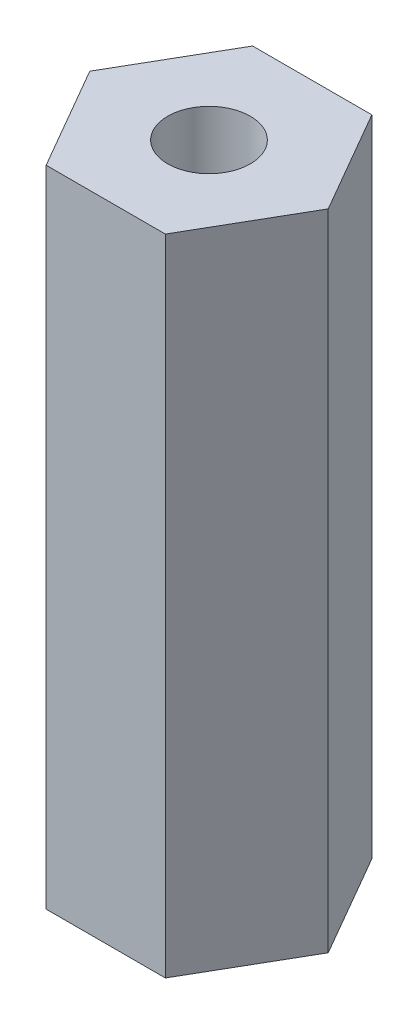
from build123d import *

# Parameters (mm, degrees)
SKETCH1_R           = 1.27
BOSS_EXTRUDE1_DEPTH = 19.812


with BuildPart() as part:
    # Sketch1 → Boss-Extrude1 (new body)
    with BuildSketch(Plane(origin=(0, 0, 0), x_dir=(1, 0, 0), z_dir=(0, 1, 0))):
        Polygon((3.666174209, 0), (1.833087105, 3.175), (-1.833087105, 3.175), (-3.666174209, 0), (-1.833087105, -3.175), (1.833087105, -3.175), align=None)
        with Locations(Location((0, 0, 0), (0, 0, 270))):
            Circle(SKETCH1_R, mode=Mode.SUBTRACT)
    extrude(amount=BOSS_EXTRUDE1_DEPTH)


solid = part.part
